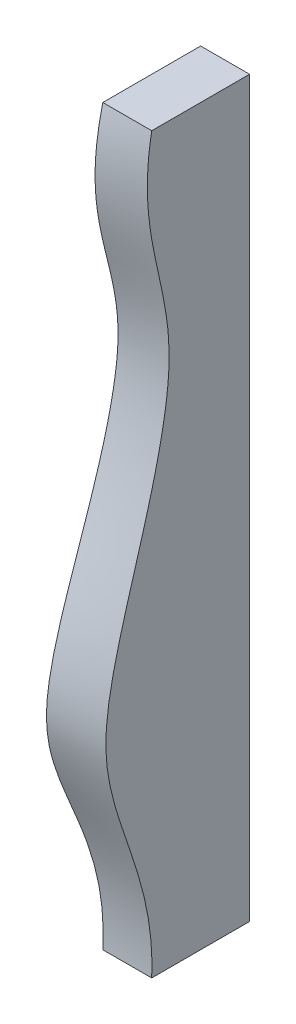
ISO-10303-21;
HEADER;
FILE_DESCRIPTION(('STEP AP214'),'2;1');
FILE_NAME('part.step','',(''),(''),'','','');
FILE_SCHEMA(('AUTOMOTIVE_DESIGN { 1 0 10303 214 1 1 1 1 }'));
ENDSEC;
DATA;
#1=APPLICATION_CONTEXT('core data for automotive mechanical design processes');
#2=APPLICATION_PROTOCOL_DEFINITION('international standard','automotive_design',2000,#1);
#3=PRODUCT_CONTEXT('',#1,'mechanical');
#4=PRODUCT('Part','Part','',(#3));
#5=PRODUCT_RELATED_PRODUCT_CATEGORY('part','',(#4));
#6=PRODUCT_DEFINITION_FORMATION('','',#4);
#7=PRODUCT_DEFINITION_CONTEXT('part definition',#1,'design');
#8=PRODUCT_DEFINITION('design','',#6,#7);
#9=PRODUCT_DEFINITION_SHAPE('','',#8);
#10=(LENGTH_UNIT() NAMED_UNIT(*) SI_UNIT(.MILLI.,.METRE.));
#11=(NAMED_UNIT(*) PLANE_ANGLE_UNIT() SI_UNIT($,.RADIAN.));
#12=(NAMED_UNIT(*) SI_UNIT($,.STERADIAN.) SOLID_ANGLE_UNIT());
#13=UNCERTAINTY_MEASURE_WITH_UNIT(LENGTH_MEASURE(1.E-05),#10,'distance_accuracy_value','');
#14=(GEOMETRIC_REPRESENTATION_CONTEXT(3) GLOBAL_UNCERTAINTY_ASSIGNED_CONTEXT((#13)) GLOBAL_UNIT_ASSIGNED_CONTEXT((#10,
#11,#12)) REPRESENTATION_CONTEXT('',''));
#15=CARTESIAN_POINT('',(0.,0.,0.));
#16=DIRECTION('',(0.,0.,1.));
#17=DIRECTION('',(1.,0.,0.));
#18=AXIS2_PLACEMENT_3D('',#15,#16,#17);
#19=CARTESIAN_POINT('',(550.,375.,253.120113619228));
#20=DIRECTION('',(1.,0.,0.));
#21=DIRECTION('',(0.,0.,-1.));
#22=AXIS2_PLACEMENT_3D('',#19,#20,#21);
#23=PLANE('',#22);
#24=CARTESIAN_POINT('',(550.,375.,100.));
#25=CARTESIAN_POINT('',(550.,373.766598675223,100.226293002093));
#26=CARTESIAN_POINT('',(550.,372.531755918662,100.444665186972));
#27=CARTESIAN_POINT('',(550.,370.059298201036,100.865180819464));
#28=CARTESIAN_POINT('',(550.,368.821683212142,101.067324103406));
#29=CARTESIAN_POINT('',(550.,365.106465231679,101.648575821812));
#30=CARTESIAN_POINT('',(550.,362.624913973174,102.002796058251));
#31=CARTESIAN_POINT('',(550.,357.654386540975,102.641695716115));
#32=CARTESIAN_POINT('',(550.,355.165415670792,102.92641643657));
#33=CARTESIAN_POINT('',(550.,350.181509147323,103.423922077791));
#34=CARTESIAN_POINT('',(550.,347.686577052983,103.636742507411));
#35=CARTESIAN_POINT('',(550.,342.692313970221,103.988558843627));
#36=CARTESIAN_POINT('',(550.,340.192984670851,104.127578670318));
#37=CARTESIAN_POINT('',(550.,335.191544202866,104.330561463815));
#38=CARTESIAN_POINT('',(550.,332.689433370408,104.394532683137));
#39=CARTESIAN_POINT('',(550.,327.751316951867,104.446294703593));
#40=CARTESIAN_POINT('',(550.,325.315331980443,104.436075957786));
#41=CARTESIAN_POINT('',(550.,320.444754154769,104.34467107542));
#42=CARTESIAN_POINT('',(550.,318.010161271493,104.263486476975));
#43=CARTESIAN_POINT('',(550.,313.144230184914,104.031732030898));
#44=CARTESIAN_POINT('',(550.,310.71289207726,103.881160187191));
#45=CARTESIAN_POINT('',(550.,305.855245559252,103.513359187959));
#46=CARTESIAN_POINT('',(550.,303.428937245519,103.296128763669));
#47=CARTESIAN_POINT('',(550.,298.583034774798,102.798961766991));
#48=CARTESIAN_POINT('',(550.,296.163439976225,102.519031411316));
#49=CARTESIAN_POINT('',(550.,291.33255220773,101.901679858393));
#50=CARTESIAN_POINT('',(550.,288.921256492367,101.564280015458));
#51=CARTESIAN_POINT('',(550.,284.115680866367,100.83954985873));
#52=CARTESIAN_POINT('',(550.,281.721371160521,100.452415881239));
#53=CARTESIAN_POINT('',(550.,276.940631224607,99.6344670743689));
#54=CARTESIAN_POINT('',(550.,274.554199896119,99.2036586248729));
#55=CARTESIAN_POINT('',(550.,269.787774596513,98.3063264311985));
#56=CARTESIAN_POINT('',(550.,267.407781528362,97.8397979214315));
#57=CARTESIAN_POINT('',(550.,262.652632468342,96.8797611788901));
#58=CARTESIAN_POINT('',(550.,260.277477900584,96.3862459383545));
#59=CARTESIAN_POINT('',(550.,255.530275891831,95.3816036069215));
#60=CARTESIAN_POINT('',(550.,253.158229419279,94.87047197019));
#61=CARTESIAN_POINT('',(550.,248.415418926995,93.8404258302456));
#62=CARTESIAN_POINT('',(550.,246.044655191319,93.3215100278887));
#63=CARTESIAN_POINT('',(550.,241.301893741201,92.2858490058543));
#64=CARTESIAN_POINT('',(550.,238.929895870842,91.7691044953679));
#65=CARTESIAN_POINT('',(550.,234.183556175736,90.7481086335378));
#66=CARTESIAN_POINT('',(550.,231.809214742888,90.2438554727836));
#67=CARTESIAN_POINT('',(550.,227.056474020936,89.2578518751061));
#68=CARTESIAN_POINT('',(550.,224.678075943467,88.7760956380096));
#69=CARTESIAN_POINT('',(550.,219.915585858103,87.8447094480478));
#70=CARTESIAN_POINT('',(550.,217.531495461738,87.39507131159));
#71=CARTESIAN_POINT('',(550.,212.756099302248,86.5369676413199));
#72=CARTESIAN_POINT('',(550.,210.364794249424,86.1284981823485));
#73=CARTESIAN_POINT('',(550.,205.573596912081,85.3610411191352));
#74=CARTESIAN_POINT('',(550.,203.173702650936,85.0020657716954));
#75=CARTESIAN_POINT('',(550.,198.324405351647,84.3355956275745));
#76=CARTESIAN_POINT('',(550.,195.874864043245,84.0290988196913));
#77=CARTESIAN_POINT('',(550.,190.967258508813,83.4820732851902));
#78=CARTESIAN_POINT('',(550.,188.50919091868,83.2415745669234));
#79=CARTESIAN_POINT('',(550.,183.586862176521,82.8323906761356));
#80=CARTESIAN_POINT('',(550.,181.122600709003,82.663709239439));
#81=CARTESIAN_POINT('',(550.,177.423450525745,82.4678007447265));
#82=CARTESIAN_POINT('',(550.,176.190021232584,82.4120186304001));
#83=CARTESIAN_POINT('',(550.,173.722424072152,82.3198774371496));
#84=CARTESIAN_POINT('',(550.,172.488256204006,82.2835183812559));
#85=CARTESIAN_POINT('',(550.,170.019792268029,82.2305644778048));
#86=CARTESIAN_POINT('',(550.,168.785496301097,82.2139649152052));
#87=CARTESIAN_POINT('',(550.,166.316799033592,82.2007662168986));
#88=CARTESIAN_POINT('',(550.,165.082397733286,82.2041670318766));
#89=CARTESIAN_POINT('',(550.,162.614127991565,82.2311139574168));
#90=CARTESIAN_POINT('',(550.,161.380259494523,82.2546549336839));
#91=CARTESIAN_POINT('',(550.,158.913079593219,82.3220442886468));
#92=CARTESIAN_POINT('',(550.,157.67976818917,82.3658926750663));
#93=CARTESIAN_POINT('',(550.,155.213489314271,82.4726365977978));
#94=CARTESIAN_POINT('',(550.,153.980522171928,82.5355396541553));
#95=CARTESIAN_POINT('',(550.,151.51562332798,82.679081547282));
#96=CARTESIAN_POINT('',(550.,150.283691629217,82.7597204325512));
#97=CARTESIAN_POINT('',(550.,147.820795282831,82.9375927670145));
#98=CARTESIAN_POINT('',(550.,146.589830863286,83.0348293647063));
#99=CARTESIAN_POINT('',(550.,144.12923723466,83.2448199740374));
#100=CARTESIAN_POINT('',(550.,142.8996080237,83.3575739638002));
#101=CARTESIAN_POINT('',(550.,139.211895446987,83.717720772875));
#102=CARTESIAN_POINT('',(550.,136.755920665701,83.9869294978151));
#103=CARTESIAN_POINT('',(550.,131.849282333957,84.5766510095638));
#104=CARTESIAN_POINT('',(550.,129.398621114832,84.897182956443));
#105=CARTESIAN_POINT('',(550.,124.503224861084,85.5837793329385));
#106=CARTESIAN_POINT('',(550.,122.058491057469,85.9498525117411));
#107=CARTESIAN_POINT('',(550.,117.175789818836,86.7230178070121));
#108=CARTESIAN_POINT('',(550.,114.737821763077,87.13010602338));
#109=CARTESIAN_POINT('',(550.,108.590047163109,88.2047589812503));
#110=CARTESIAN_POINT('',(550.,104.884523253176,88.8968659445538));
#111=CARTESIAN_POINT('',(550.,97.4897891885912,90.3545183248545));
#112=CARTESIAN_POINT('',(550.,93.8005724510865,91.1200305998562));
#113=CARTESIAN_POINT('',(550.,86.4363813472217,92.7141691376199));
#114=CARTESIAN_POINT('',(550.,82.761405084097,93.5427866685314));
#115=CARTESIAN_POINT('',(550.,75.4239869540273,95.2540986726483));
#116=CARTESIAN_POINT('',(550.,71.7615454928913,96.1367948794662));
#117=CARTESIAN_POINT('',(550.,64.447702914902,97.9481942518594));
#118=CARTESIAN_POINT('',(550.,60.796302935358,98.8769019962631));
#119=CARTESIAN_POINT('',(550.,53.5032161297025,100.77294120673));
#120=CARTESIAN_POINT('',(550.,49.8615302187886,101.740276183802));
#121=CARTESIAN_POINT('',(550.,42.5455349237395,103.717772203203));
#122=CARTESIAN_POINT('',(550.,38.8713233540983,104.728294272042));
#123=CARTESIAN_POINT('',(550.,31.5301570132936,106.774988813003));
#124=CARTESIAN_POINT('',(550.,27.8632020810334,107.811160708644));
#125=CARTESIAN_POINT('',(550.,20.5351230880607,109.902516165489));
#126=CARTESIAN_POINT('',(550.,16.8739984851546,110.95769783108));
#127=CARTESIAN_POINT('',(550.,9.55614718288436,113.080405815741));
#128=CARTESIAN_POINT('',(550.,5.8994197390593,114.147929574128));
#129=CARTESIAN_POINT('',(550.,-1.41112448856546,116.288466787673));
#130=CARTESIAN_POINT('',(550.,-5.06494183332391,117.361478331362));
#131=CARTESIAN_POINT('',(550.,-12.3712560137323,119.505779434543));
#132=CARTESIAN_POINT('',(550.,-16.0237526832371,120.577069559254));
#133=CARTESIAN_POINT('',(550.,-23.3817516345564,122.725532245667));
#134=CARTESIAN_POINT('',(550.,-27.0872898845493,123.802582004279));
#135=CARTESIAN_POINT('',(550.,-34.5029335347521,125.938650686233));
#136=CARTESIAN_POINT('',(550.,-38.2130381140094,126.997672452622));
#137=CARTESIAN_POINT('',(550.,-45.6423294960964,129.088308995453));
#138=CARTESIAN_POINT('',(550.,-49.3615189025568,130.119914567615));
#139=CARTESIAN_POINT('',(550.,-54.9499670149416,131.638301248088));
#140=CARTESIAN_POINT('',(550.,-56.815224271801,132.139809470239));
#141=CARTESIAN_POINT('',(550.,-60.5487858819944,133.131342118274));
#142=CARTESIAN_POINT('',(550.,-62.4170902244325,133.621366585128));
#143=CARTESIAN_POINT('',(550.,-66.1600131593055,134.58892580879));
#144=CARTESIAN_POINT('',(550.,-68.0346370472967,135.066440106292));
#145=CARTESIAN_POINT('',(550.,-71.7876997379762,136.006259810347));
#146=CARTESIAN_POINT('',(550.,-73.6661385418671,136.468565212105));
#147=CARTESIAN_POINT('',(550.,-77.4316720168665,137.376932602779));
#148=CARTESIAN_POINT('',(550.,-79.3187766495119,137.822953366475));
#149=CARTESIAN_POINT('',(550.,-83.0975512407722,138.695254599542));
#150=CARTESIAN_POINT('',(550.,-84.9892211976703,139.121535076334));
#151=CARTESIAN_POINT('',(550.,-88.7245073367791,139.940179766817));
#152=CARTESIAN_POINT('',(550.,-90.5679884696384,140.333158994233));
#153=CARTESIAN_POINT('',(550.,-94.2598510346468,141.095440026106));
#154=CARTESIAN_POINT('',(550.,-96.1082324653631,141.464741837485));
#155=CARTESIAN_POINT('',(550.,-99.8110479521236,142.176994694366));
#156=CARTESIAN_POINT('',(550.,-101.665484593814,142.519932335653));
#157=CARTESIAN_POINT('',(550.,-105.379624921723,143.176110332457));
#158=CARTESIAN_POINT('',(550.,-107.23932861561,143.489350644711));
#159=CARTESIAN_POINT('',(550.,-110.961128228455,144.082223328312));
#160=CARTESIAN_POINT('',(550.,-112.823215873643,144.361907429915));
#161=CARTESIAN_POINT('',(550.,-116.552565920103,144.884478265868));
#162=CARTESIAN_POINT('',(550.,-118.419828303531,145.127365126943));
#163=CARTESIAN_POINT('',(550.,-122.153865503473,145.571607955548));
#164=CARTESIAN_POINT('',(550.,-124.020626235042,145.773081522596));
#165=CARTESIAN_POINT('',(550.,-127.758509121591,146.130977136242));
#166=CARTESIAN_POINT('',(550.,-129.629631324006,146.287398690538));
#167=CARTESIAN_POINT('',(550.,-133.369729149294,146.550062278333));
#168=CARTESIAN_POINT('',(550.,-135.238693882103,146.656456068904));
#169=CARTESIAN_POINT('',(550.,-138.043810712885,146.775205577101));
#170=CARTESIAN_POINT('',(550.,-138.979127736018,146.807981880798));
#171=CARTESIAN_POINT('',(550.,-140.850161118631,146.85927264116));
#172=CARTESIAN_POINT('',(550.,-141.785877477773,146.877787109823));
#173=CARTESIAN_POINT('',(550.,-143.655861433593,146.899893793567));
#174=CARTESIAN_POINT('',(550.,-144.590128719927,146.903511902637));
#175=CARTESIAN_POINT('',(550.,-146.458593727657,146.89518659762));
#176=CARTESIAN_POINT('',(550.,-147.39279144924,146.883243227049));
#177=CARTESIAN_POINT('',(550.,-149.260883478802,146.843806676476));
#178=CARTESIAN_POINT('',(550.,-150.194777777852,146.816313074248));
#179=CARTESIAN_POINT('',(550.,-152.061991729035,146.745949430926));
#180=CARTESIAN_POINT('',(550.,-152.995311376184,146.703079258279));
#181=CARTESIAN_POINT('',(550.,-155.097300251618,146.589395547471));
#182=CARTESIAN_POINT('',(550.,-156.265737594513,146.51425550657));
#183=CARTESIAN_POINT('',(550.,-158.600887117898,146.340741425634));
#184=CARTESIAN_POINT('',(550.,-159.767599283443,146.242367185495));
#185=CARTESIAN_POINT('',(550.,-162.098932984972,146.023021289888));
#186=CARTESIAN_POINT('',(550.,-163.263554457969,145.902048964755));
#187=CARTESIAN_POINT('',(550.,-165.59031461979,145.638145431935));
#188=CARTESIAN_POINT('',(550.,-166.752453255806,145.495213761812));
#189=CARTESIAN_POINT('',(550.,-170.242024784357,145.033591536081));
#190=CARTESIAN_POINT('',(550.,-172.565272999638,144.682772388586));
#191=CARTESIAN_POINT('',(550.,-177.198357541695,143.90254763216));
#192=CARTESIAN_POINT('',(550.,-179.508194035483,143.473143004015));
#193=CARTESIAN_POINT('',(550.,-184.120324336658,142.54223613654));
#194=CARTESIAN_POINT('',(550.,-186.422575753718,142.04052482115));
#195=CARTESIAN_POINT('',(550.,-191.012606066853,140.974465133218));
#196=CARTESIAN_POINT('',(550.,-193.300383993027,140.410112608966));
#197=CARTESIAN_POINT('',(550.,-197.862864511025,139.227395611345));
#198=CARTESIAN_POINT('',(550.,-200.137561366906,138.609009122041));
#199=CARTESIAN_POINT('',(550.,-204.674150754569,137.327324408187));
#200=CARTESIAN_POINT('',(550.,-206.936043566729,136.664027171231));
#201=CARTESIAN_POINT('',(550.,-211.506829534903,135.283733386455));
#202=CARTESIAN_POINT('',(550.,-213.815437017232,134.565794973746));
#203=CARTESIAN_POINT('',(550.,-218.423407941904,133.100954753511));
#204=CARTESIAN_POINT('',(550.,-220.722771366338,132.354052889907));
#205=CARTESIAN_POINT('',(550.,-225.3099588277,130.841590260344));
#206=CARTESIAN_POINT('',(550.,-227.597796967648,130.076072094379));
#207=CARTESIAN_POINT('',(550.,-232.169420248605,128.533085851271));
#208=CARTESIAN_POINT('',(550.,-234.453205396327,127.75561779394));
#209=CARTESIAN_POINT('',(550.,-239.017689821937,126.197065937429));
#210=CARTESIAN_POINT('',(550.,-241.298390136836,125.415985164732));
#211=CARTESIAN_POINT('',(550.,-245.860872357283,123.856968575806));
#212=CARTESIAN_POINT('',(550.,-248.142654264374,123.079032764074));
#213=CARTESIAN_POINT('',(550.,-252.71077454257,121.532829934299));
#214=CARTESIAN_POINT('',(550.,-254.997114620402,120.764567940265));
#215=CARTESIAN_POINT('',(550.,-259.575297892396,119.244639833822));
#216=CARTESIAN_POINT('',(550.,-261.86714104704,118.49297360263));
#217=CARTESIAN_POINT('',(550.,-267.161938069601,116.78545362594));
#218=CARTESIAN_POINT('',(550.,-270.167501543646,115.837646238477));
#219=CARTESIAN_POINT('',(550.,-276.196343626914,113.993174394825));
#220=CARTESIAN_POINT('',(550.,-279.219631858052,113.09654124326));
#221=CARTESIAN_POINT('',(550.,-285.284365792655,111.366884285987));
#222=CARTESIAN_POINT('',(550.,-288.325811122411,110.53385917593));
#223=CARTESIAN_POINT('',(550.,-294.426942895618,108.942531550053));
#224=CARTESIAN_POINT('',(550.,-297.486621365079,108.184198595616));
#225=CARTESIAN_POINT('',(550.,-303.623940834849,106.751988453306));
#226=CARTESIAN_POINT('',(550.,-306.701570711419,106.078063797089));
#227=CARTESIAN_POINT('',(550.,-312.87416084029,104.823036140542));
#228=CARTESIAN_POINT('',(550.,-315.969111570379,104.241886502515));
#229=CARTESIAN_POINT('',(550.,-322.138501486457,103.185742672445));
#230=CARTESIAN_POINT('',(550.,-325.212734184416,102.709546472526));
#231=CARTESIAN_POINT('',(550.,-331.375758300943,101.860195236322));
#232=CARTESIAN_POINT('',(550.,-334.464551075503,101.487049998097));
#233=CARTESIAN_POINT('',(550.,-340.655825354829,100.848059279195));
#234=CARTESIAN_POINT('',(550.,-343.758316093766,100.582303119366));
#235=CARTESIAN_POINT('',(550.,-349.976181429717,100.161315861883));
#236=CARTESIAN_POINT('',(550.,-353.091568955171,100.006273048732));
#237=CARTESIAN_POINT('',(550.,-357.771309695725,99.8583590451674));
#238=CARTESIAN_POINT('',(550.,-359.334431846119,99.8231726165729));
#239=CARTESIAN_POINT('',(550.,-362.461078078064,99.7812956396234));
#240=CARTESIAN_POINT('',(550.,-364.024602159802,99.7746051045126));
#241=CARTESIAN_POINT('',(550.,-367.157202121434,99.7897852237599));
#242=CARTESIAN_POINT('',(550.,-368.726277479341,99.8117600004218));
#243=CARTESIAN_POINT('',(550.,-371.863765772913,99.8843874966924));
#244=CARTESIAN_POINT('',(550.,-373.432178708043,99.9350402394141));
#245=CARTESIAN_POINT('',(550.,-375.,100.));
#246=B_SPLINE_CURVE_WITH_KNOTS('',3,(#24,#25,#26,#27,#28,#29,#30,#31,#32,#33,#34,#35,#36,#37,
#38,#39,#40,#41,#42,#43,#44,#45,#46,#47,#48,#49,#50,#51,#52,#53,#54,#55,#56,#57,#58,#59,#60,#61,
#62,#63,#64,#65,#66,#67,#68,#69,#70,#71,#72,#73,#74,#75,#76,#77,#78,#79,#80,#81,#82,#83,#84,#85,
#86,#87,#88,#89,#90,#91,#92,#93,#94,#95,#96,#97,#98,#99,#100,#101,#102,#103,#104,#105,#106,#107,
#108,#109,#110,#111,#112,#113,#114,#115,#116,#117,#118,#119,#120,#121,#122,#123,#124,#125,#126,
#127,#128,#129,#130,#131,#132,#133,#134,#135,#136,#137,#138,#139,#140,#141,#142,#143,#144,#145,
#146,#147,#148,#149,#150,#151,#152,#153,#154,#155,#156,#157,#158,#159,#160,#161,#162,#163,#164,
#165,#166,#167,#168,#169,#170,#171,#172,#173,#174,#175,#176,#177,#178,#179,#180,#181,#182,#183,
#184,#185,#186,#187,#188,#189,#190,#191,#192,#193,#194,#195,#196,#197,#198,#199,#200,#201,#202,
#203,#204,#205,#206,#207,#208,#209,#210,#211,#212,#213,#214,#215,#216,#217,#218,#219,#220,#221,
#222,#223,#224,#225,#226,#227,#228,#229,#230,#231,#232,#233,#234,#235,#236,#237,#238,#239,#240,
#241,#242,#243,#244,#245),.UNSPECIFIED.,.F.,.F.,(4,2,2,2,2,2,2,2,2,2,2,2,2,2,2,2,2,2,2,2,2,2,2,
2,2,2,2,2,2,2,2,2,2,2,2,2,2,2,2,2,2,2,2,2,2,2,2,2,2,2,2,2,2,2,2,2,2,2,2,2,2,2,2,2,2,2,2,2,2,2,2,
2,2,2,2,2,2,2,2,2,2,2,2,2,2,2,2,2,2,2,2,2,2,2,2,2,2,2,2,2,2,2,2,2,2,2,2,2,2,2,4),(0.,
3.76191391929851,7.52386577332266,15.0429658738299,22.5575869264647,30.0684913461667,
37.5769598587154,45.0846026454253,52.3915808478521,59.6984006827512,67.005430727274,
74.3125998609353,81.6190448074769,88.9227807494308,96.198522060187,103.473202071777,
110.748854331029,118.026404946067,125.305847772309,132.586519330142,139.869408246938,
147.151235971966,154.431175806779,161.709254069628,168.986637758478,176.265820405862,
183.670925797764,191.079392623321,198.488244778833,202.192188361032,205.896136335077,
209.599200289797,213.302255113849,217.004366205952,220.706478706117,224.410054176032,
228.1136397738,231.817928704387,235.522212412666,242.93358729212,250.347735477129,
257.763310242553,265.178180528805,276.486047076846,287.788832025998,299.090055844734,
310.391642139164,321.694355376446,332.998098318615,344.429903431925,355.86145184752,
367.291866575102,378.719950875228,390.144294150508,401.563379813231,413.140031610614,
424.714840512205,436.29348748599,442.087960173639,447.882412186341,453.685813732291,
459.489217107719,465.306415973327,471.123612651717,476.778180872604,482.432747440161,
488.090170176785,493.747601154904,499.396195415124,505.044770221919,510.677076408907,
516.30944414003,521.92461431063,524.732198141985,527.53977961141,530.342478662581,
533.145169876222,535.947937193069,538.750728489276,542.263033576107,545.775368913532,
549.28780835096,552.800321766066,559.84745522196,566.894500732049,573.962347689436,
581.030663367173,588.10187255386,595.172926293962,602.425667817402,609.678423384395,
616.91590742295,624.153379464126,631.385609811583,638.617850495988,645.853703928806,
653.089505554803,662.543548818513,672.003314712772,681.462886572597,690.91858736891,
700.368946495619,709.814539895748,719.145573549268,728.477494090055,737.817160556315,
747.172672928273,751.863013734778,756.553356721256,761.260784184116,765.968215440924),.UNSPECIFIED.);
#247=CARTESIAN_POINT('',(550.,375.,100.));
#248=VERTEX_POINT('',#247);
#249=CARTESIAN_POINT('',(550.,-375.,100.));
#250=VERTEX_POINT('',#249);
#251=EDGE_CURVE('E88',#248,#250,#246,.T.);
#252=ORIENTED_EDGE('',*,*,#251,.T.);
#253=DIRECTION('',(0.,0.,-1.));
#254=VECTOR('',#253,1.);
#255=CARTESIAN_POINT('',(550.,-375.,253.120113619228));
#256=LINE('',#255,#254);
#257=CARTESIAN_POINT('',(550.,-375.,0.));
#258=VERTEX_POINT('',#257);
#259=EDGE_CURVE('E50',#250,#258,#256,.T.);
#260=ORIENTED_EDGE('',*,*,#259,.T.);
#261=DIRECTION('',(0.,-1.,0.));
#262=VECTOR('',#261,1.);
#263=CARTESIAN_POINT('',(550.,375.,0.));
#264=LINE('',#263,#262);
#265=CARTESIAN_POINT('',(550.,375.,0.));
#266=VERTEX_POINT('',#265);
#267=EDGE_CURVE('E87',#266,#258,#264,.T.);
#268=ORIENTED_EDGE('',*,*,#267,.F.);
#269=DIRECTION('',(0.,0.,-1.));
#270=VECTOR('',#269,1.);
#271=CARTESIAN_POINT('',(550.,375.,253.120113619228));
#272=LINE('',#271,#270);
#273=EDGE_CURVE('E65',#248,#266,#272,.T.);
#274=ORIENTED_EDGE('',*,*,#273,.F.);
#275=EDGE_LOOP('',(#252,#260,#268,#274));
#276=FACE_BOUND('',#275,.T.);
#277=ADVANCED_FACE('F35',(#276),#23,.T.);
#278=CARTESIAN_POINT('',(0.,0.,0.));
#279=DIRECTION('',(0.,0.,-1.));
#280=DIRECTION('',(-1.,0.,0.));
#281=AXIS2_PLACEMENT_3D('',#278,#279,#280);
#282=PLANE('',#281);
#283=DIRECTION('',(1.,0.,0.));
#284=VECTOR('',#283,1.);
#285=CARTESIAN_POINT('',(-750.,-375.,0.));
#286=LINE('',#285,#284);
#287=CARTESIAN_POINT('',(500.,-375.,0.));
#288=VERTEX_POINT('',#287);
#289=EDGE_CURVE('E79',#288,#258,#286,.T.);
#290=ORIENTED_EDGE('',*,*,#289,.F.);
#291=DIRECTION('',(0.,1.,0.));
#292=VECTOR('',#291,1.);
#293=CARTESIAN_POINT('',(500.,375.,0.));
#294=LINE('',#293,#292);
#295=CARTESIAN_POINT('',(500.,375.,0.));
#296=VERTEX_POINT('',#295);
#297=EDGE_CURVE('E157',#288,#296,#294,.T.);
#298=ORIENTED_EDGE('',*,*,#297,.T.);
#299=DIRECTION('',(-1.,0.,0.));
#300=VECTOR('',#299,1.);
#301=CARTESIAN_POINT('',(-750.,375.,0.));
#302=LINE('',#301,#300);
#303=EDGE_CURVE('E93',#266,#296,#302,.T.);
#304=ORIENTED_EDGE('',*,*,#303,.F.);
#305=ORIENTED_EDGE('',*,*,#267,.T.);
#306=EDGE_LOOP('',(#290,#298,#304,#305));
#307=FACE_BOUND('',#306,.T.);
#308=ADVANCED_FACE('F91',(#307),#282,.T.);
#309=CARTESIAN_POINT('',(750.,-375.,100.));
#310=CARTESIAN_POINT('',(750.,-302.078506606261,100.));
#311=CARTESIAN_POINT('',(750.,-224.483786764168,100.));
#312=CARTESIAN_POINT('',(750.,-61.5160152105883,100.));
#313=CARTESIAN_POINT('',(750.,39.4445673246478,100.));
#314=CARTESIAN_POINT('',(750.,211.849847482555,100.));
#315=CARTESIAN_POINT('',(750.,298.882075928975,100.));
#316=CARTESIAN_POINT('',(750.,375.,100.));
#317=CARTESIAN_POINT('',(669.085175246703,-375.,100.));
#318=CARTESIAN_POINT('',(669.085175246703,-302.078506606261,100.));
#319=CARTESIAN_POINT('',(669.085175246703,-234.282472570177,121.198481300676));
#320=CARTESIAN_POINT('',(669.085175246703,-62.2283080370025,120.288550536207));
#321=CARTESIAN_POINT('',(669.085175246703,68.0647781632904,82.7868169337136));
#322=CARTESIAN_POINT('',(669.085175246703,240.312514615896,73.0426687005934));
#323=CARTESIAN_POINT('',(669.085175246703,298.882075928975,100.));
#324=CARTESIAN_POINT('',(669.085175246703,375.,100.));
#325=CARTESIAN_POINT('',(500.445116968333,-375.,100.));
#326=CARTESIAN_POINT('',(517.991528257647,-284.627602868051,95.5040591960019));
#327=CARTESIAN_POINT('',(530.038001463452,-221.673003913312,150.719602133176));
#328=CARTESIAN_POINT('',(473.74510655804,-71.7416270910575,167.060530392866));
#329=CARTESIAN_POINT('',(387.213321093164,45.6135081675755,91.591323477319));
#330=CARTESIAN_POINT('',(378.694107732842,207.638743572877,66.6461848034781));
#331=CARTESIAN_POINT('',(433.17831170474,253.396603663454,122.492891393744));
#332=CARTESIAN_POINT('',(500.445116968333,375.,100.));
#333=CARTESIAN_POINT('',(285.091607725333,-375.,100.));
#334=CARTESIAN_POINT('',(309.270321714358,-264.297524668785,86.4064578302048));
#335=CARTESIAN_POINT('',(325.856840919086,-200.08226970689,164.07204721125));
#336=CARTESIAN_POINT('',(247.47112957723,-80.9425320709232,234.992870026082));
#337=CARTESIAN_POINT('',(127.240382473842,2.40271344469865,186.756001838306));
#338=CARTESIAN_POINT('',(115.567806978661,152.518027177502,151.057444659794));
#339=CARTESIAN_POINT('',(191.428893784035,202.025100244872,189.039851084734));
#340=CARTESIAN_POINT('',(285.091607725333,375.,100.));
#341=CARTESIAN_POINT('',(47.4554331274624,-375.,100.));
#342=CARTESIAN_POINT('',(51.0669239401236,-278.639867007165,99.5141662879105));
#343=CARTESIAN_POINT('',(52.9210710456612,-231.452124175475,201.325948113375));
#344=CARTESIAN_POINT('',(3.18149891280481,-90.8615864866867,272.445475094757));
#345=CARTESIAN_POINT('',(-61.0346058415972,45.7948958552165,186.157760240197));
#346=CARTESIAN_POINT('',(-59.6612105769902,205.286893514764,133.941969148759));
#347=CARTESIAN_POINT('',(-11.8049718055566,220.40073671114,189.8209162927));
#348=CARTESIAN_POINT('',(47.4554331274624,375.,100.));
#349=CARTESIAN_POINT('',(-175.903454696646,-375.,100.));
#350=CARTESIAN_POINT('',(-199.823715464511,-320.588060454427,126.731848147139));
#351=CARTESIAN_POINT('',(-216.967937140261,-300.821135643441,242.921959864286));
#352=CARTESIAN_POINT('',(-184.265304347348,-55.1410097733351,206.147478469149));
#353=CARTESIAN_POINT('',(-119.865061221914,249.096629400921,-32.5779079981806));
#354=CARTESIAN_POINT('',(-104.641938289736,431.262460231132,-94.4845569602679));
#355=CARTESIAN_POINT('',(-136.623034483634,348.137040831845,60.785640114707));
#356=CARTESIAN_POINT('',(-175.903454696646,375.,100.));
#357=CARTESIAN_POINT('',(-355.235514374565,-375.,100.));
#358=CARTESIAN_POINT('',(-319.200833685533,-282.590755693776,58.2859511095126));
#359=CARTESIAN_POINT('',(-293.075279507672,-226.888141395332,104.97090627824));
#360=CARTESIAN_POINT('',(-324.119079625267,-68.6572837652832,122.102733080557));
#361=CARTESIAN_POINT('',(-398.972481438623,73.039345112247,53.3701087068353));
#362=CARTESIAN_POINT('',(-423.398679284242,233.384819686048,47.4380317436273));
#363=CARTESIAN_POINT('',(-392.720188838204,253.575952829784,124.952096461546));
#364=CARTESIAN_POINT('',(-355.235514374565,375.,100.));
#365=CARTESIAN_POINT('',(-536.684515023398,-375.,100.));
#366=CARTESIAN_POINT('',(-494.827225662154,-277.129657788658,52.0422385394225));
#367=CARTESIAN_POINT('',(-464.573647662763,-205.017596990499,67.039018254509));
#368=CARTESIAN_POINT('',(-506.334367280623,-72.2467511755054,96.5036749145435));
#369=CARTESIAN_POINT('',(-600.216684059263,9.35641022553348,95.9941925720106));
#370=CARTESIAN_POINT('',(-628.122542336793,166.946160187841,106.349064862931));
#371=CARTESIAN_POINT('',(-587.011939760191,237.095914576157,138.331902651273));
#372=CARTESIAN_POINT('',(-536.684515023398,375.,100.));
#373=CARTESIAN_POINT('',(-644.685568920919,-375.,100.));
#374=CARTESIAN_POINT('',(-644.685568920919,-302.078506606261,100.));
#375=CARTESIAN_POINT('',(-644.685568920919,-237.237234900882,127.59081546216));
#376=CARTESIAN_POINT('',(-644.685568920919,-62.4430976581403,126.406497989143));
#377=CARTESIAN_POINT('',(-644.685568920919,76.6951111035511,77.5962366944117));
#378=CARTESIAN_POINT('',(-644.685568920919,248.895340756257,64.9137717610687));
#379=CARTESIAN_POINT('',(-644.685568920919,298.882075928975,100.));
#380=CARTESIAN_POINT('',(-644.685568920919,375.,100.));
#381=CARTESIAN_POINT('',(-750.,-375.,100.));
#382=CARTESIAN_POINT('',(-750.,-302.078506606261,100.));
#383=CARTESIAN_POINT('',(-750.,-224.483786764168,100.));
#384=CARTESIAN_POINT('',(-750.,-61.5160152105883,100.));
#385=CARTESIAN_POINT('',(-750.,39.4445673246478,100.));
#386=CARTESIAN_POINT('',(-750.,211.849847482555,100.));
#387=CARTESIAN_POINT('',(-750.,298.882075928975,100.));
#388=CARTESIAN_POINT('',(-750.,375.,100.));
#389=B_SPLINE_SURFACE_WITH_KNOTS('',3,3,((#309,#310,#311,#312,#313,#314,#315,#316),(#317,#318,
#319,#320,#321,#322,#323,#324),(#325,#326,#327,#328,#329,#330,#331,#332),(#333,#334,#335,#336,
#337,#338,#339,#340),(#341,#342,#343,#344,#345,#346,#347,#348),(#349,#350,#351,#352,#353,#354,
#355,#356),(#357,#358,#359,#360,#361,#362,#363,#364),(#365,#366,#367,#368,#369,#370,#371,#372),
(#373,#374,#375,#376,#377,#378,#379,#380),(#381,#382,#383,#384,#385,#386,#387,#388)),
.UNSPECIFIED.,.F.,.F.,.F.,(4,1,1,1,1,1,1,4),(4,1,1,1,1,4),(0.,0.161829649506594,
0.33728011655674,0.430707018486,0.637101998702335,0.783997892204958,0.789371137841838,1.),(0.,
0.291685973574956,0.310378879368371,0.65187108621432,0.695528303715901,1.),.UNSPECIFIED.);
#390=CARTESIAN_POINT('',(500.,-375.,100.));
#391=CARTESIAN_POINT('',(500.,-373.86579472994,99.9348858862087));
#392=CARTESIAN_POINT('',(500.,-372.731146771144,99.8777348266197));
#393=CARTESIAN_POINT('',(500.,-370.461153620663,99.7794710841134));
#394=CARTESIAN_POINT('',(500.,-369.325808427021,99.7383584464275));
#395=CARTESIAN_POINT('',(500.,-365.920852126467,99.6393003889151));
#396=CARTESIAN_POINT('',(500.,-363.650488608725,99.6055293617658));
#397=CARTESIAN_POINT('',(500.,-359.111140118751,99.6031119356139));
#398=CARTESIAN_POINT('',(500.,-356.842155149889,99.6344258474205));
#399=CARTESIAN_POINT('',(500.,-352.306971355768,99.7623367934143));
#400=CARTESIAN_POINT('',(500.,-350.040771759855,99.8589063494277));
#401=CARTESIAN_POINT('',(500.,-345.51261150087,100.11716902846));
#402=CARTESIAN_POINT('',(500.,-343.250649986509,100.278847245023));
#403=CARTESIAN_POINT('',(500.,-338.732390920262,100.666822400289));
#404=CARTESIAN_POINT('',(500.,-336.476093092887,100.893116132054));
#405=CARTESIAN_POINT('',(500.,-332.044540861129,101.400970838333));
#406=CARTESIAN_POINT('',(500.,-329.869050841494,101.680480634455));
#407=CARTESIAN_POINT('',(500.,-325.526227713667,102.2979496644));
#408=CARTESIAN_POINT('',(500.,-323.358895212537,102.635913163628));
#409=CARTESIAN_POINT('',(500.,-319.033669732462,103.368762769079));
#410=CARTESIAN_POINT('',(500.,-316.875777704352,103.763654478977));
#411=CARTESIAN_POINT('',(500.,-312.57063932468,104.608462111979));
#412=CARTESIAN_POINT('',(500.,-310.423393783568,105.05838215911));
#413=CARTESIAN_POINT('',(500.,-306.140681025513,106.010967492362));
#414=CARTESIAN_POINT('',(500.,-304.005213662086,106.513632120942));
#415=CARTESIAN_POINT('',(500.,-299.747113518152,107.569039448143));
#416=CARTESIAN_POINT('',(500.,-297.624478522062,108.121773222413));
#417=CARTESIAN_POINT('',(500.,-293.399919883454,109.272378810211));
#418=CARTESIAN_POINT('',(500.,-291.297948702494,109.870076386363));
#419=CARTESIAN_POINT('',(500.,-287.107201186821,111.109177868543));
#420=CARTESIAN_POINT('',(500.,-285.018423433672,111.75057698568));
#421=CARTESIAN_POINT('',(500.,-280.853663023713,113.073740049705));
#422=CARTESIAN_POINT('',(500.,-278.777680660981,113.755504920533));
#423=CARTESIAN_POINT('',(500.,-274.638009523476,115.155758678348));
#424=CARTESIAN_POINT('',(500.,-272.574321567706,115.874249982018));
#425=CARTESIAN_POINT('',(500.,-268.458632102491,117.344003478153));
#426=CARTESIAN_POINT('',(500.,-266.406630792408,118.095266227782));
#427=CARTESIAN_POINT('',(500.,-262.313597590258,119.62628388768));
#428=CARTESIAN_POINT('',(500.,-260.272564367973,120.406035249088));
#429=CARTESIAN_POINT('',(500.,-256.16835243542,122.001968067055));
#430=CARTESIAN_POINT('',(500.,-254.105320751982,122.818526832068));
#431=CARTESIAN_POINT('',(500.,-249.987613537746,124.471522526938));
#432=CARTESIAN_POINT('',(500.,-247.932936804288,125.307956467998));
#433=CARTESIAN_POINT('',(500.,-243.829734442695,126.995582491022));
#434=CARTESIAN_POINT('',(500.,-241.781208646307,127.846774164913));
#435=CARTESIAN_POINT('',(500.,-237.687946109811,129.558418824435));
#436=CARTESIAN_POINT('',(500.,-235.643209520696,130.418872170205));
#437=CARTESIAN_POINT('',(500.,-231.55499033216,132.143130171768));
#438=CARTESIAN_POINT('',(500.,-229.511507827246,133.006935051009));
#439=CARTESIAN_POINT('',(500.,-225.423073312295,134.731536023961));
#440=CARTESIAN_POINT('',(500.,-223.378121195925,135.592331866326));
#441=CARTESIAN_POINT('',(500.,-219.261281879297,137.313492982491));
#442=CARTESIAN_POINT('',(500.,-217.189348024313,138.173747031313));
#443=CARTESIAN_POINT('',(500.,-213.038221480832,139.876372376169));
#444=CARTESIAN_POINT('',(500.,-210.959029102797,140.718744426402));
#445=CARTESIAN_POINT('',(500.,-206.790323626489,142.377274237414));
#446=CARTESIAN_POINT('',(500.,-204.70081117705,143.193433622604));
#447=CARTESIAN_POINT('',(500.,-200.50819100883,144.790649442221));
#448=CARTESIAN_POINT('',(500.,-198.405082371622,145.571703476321));
#449=CARTESIAN_POINT('',(500.,-194.181790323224,147.089277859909));
#450=CARTESIAN_POINT('',(500.,-192.06160014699,147.825779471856));
#451=CARTESIAN_POINT('',(500.,-187.800469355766,149.244315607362));
#452=CARTESIAN_POINT('',(500.,-185.659509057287,149.926291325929));
#453=CARTESIAN_POINT('',(500.,-181.401617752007,151.210739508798));
#454=CARTESIAN_POINT('',(500.,-179.285094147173,151.814555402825));
#455=CARTESIAN_POINT('',(500.,-175.031010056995,152.948591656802));
#456=CARTESIAN_POINT('',(500.,-172.893438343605,153.478770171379));
#457=CARTESIAN_POINT('',(500.,-168.600225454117,154.454607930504));
#458=CARTESIAN_POINT('',(500.,-166.444594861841,154.900313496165));
#459=CARTESIAN_POINT('',(500.,-162.118330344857,155.697559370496));
#460=CARTESIAN_POINT('',(500.,-159.947716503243,156.049207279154));
#461=CARTESIAN_POINT('',(500.,-156.68272614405,156.500178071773));
#462=CARTESIAN_POINT('',(500.,-155.593527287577,156.63769309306));
#463=CARTESIAN_POINT('',(500.,-153.412128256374,156.886244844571));
#464=CARTESIAN_POINT('',(500.,-152.319928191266,156.997282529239));
#465=CARTESIAN_POINT('',(500.,-150.134071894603,157.191879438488));
#466=CARTESIAN_POINT('',(500.,-149.040417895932,157.275463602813));
#467=CARTESIAN_POINT('',(500.,-147.398624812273,157.379842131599));
#468=CARTESIAN_POINT('',(500.,-146.851137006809,157.41113553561));
#469=CARTESIAN_POINT('',(500.,-145.755800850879,157.466652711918));
#470=CARTESIAN_POINT('',(500.,-145.207952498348,157.490876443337));
#471=CARTESIAN_POINT('',(500.,-143.404247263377,157.558985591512));
#472=CARTESIAN_POINT('',(500.,-142.147790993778,157.5878596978));
#473=CARTESIAN_POINT('',(500.,-139.634597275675,157.610610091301));
#474=CARTESIAN_POINT('',(500.,-138.377859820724,157.604485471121));
#475=CARTESIAN_POINT('',(500.,-134.605541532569,157.536626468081));
#476=CARTESIAN_POINT('',(500.,-132.09073725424,157.425307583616));
#477=CARTESIAN_POINT('',(500.,-127.065365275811,157.08672619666));
#478=CARTESIAN_POINT('',(500.,-124.55481050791,156.859281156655));
#479=CARTESIAN_POINT('',(500.,-119.542359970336,156.303657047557));
#480=CARTESIAN_POINT('',(500.,-117.040476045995,155.975372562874));
#481=CARTESIAN_POINT('',(500.,-112.050131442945,155.232434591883));
#482=CARTESIAN_POINT('',(500.,-109.561668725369,154.817794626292));
#483=CARTESIAN_POINT('',(500.,-104.551894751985,153.906316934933));
#484=CARTESIAN_POINT('',(500.,-102.030838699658,153.408087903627));
#485=CARTESIAN_POINT('',(500.,-97.0055311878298,152.347422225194));
#486=CARTESIAN_POINT('',(500.,-94.5012631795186,151.785063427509));
#487=CARTESIAN_POINT('',(500.,-89.5071685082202,150.606106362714));
#488=CARTESIAN_POINT('',(500.,-87.0173341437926,149.989540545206));
#489=CARTESIAN_POINT('',(500.,-82.0500968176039,148.710748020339));
#490=CARTESIAN_POINT('',(500.,-79.5726910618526,148.048532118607));
#491=CARTESIAN_POINT('',(500.,-74.6285909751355,146.685864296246));
#492=CARTESIAN_POINT('',(500.,-72.1618961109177,145.985414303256));
#493=CARTESIAN_POINT('',(500.,-66.9310878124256,144.463545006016));
#494=CARTESIAN_POINT('',(500.,-64.168199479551,143.637925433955));
#495=CARTESIAN_POINT('',(500.,-58.6519796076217,141.95446061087));
#496=CARTESIAN_POINT('',(500.,-55.8986490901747,141.096612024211));
#497=CARTESIAN_POINT('',(500.,-50.3995585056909,139.355501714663));
#498=CARTESIAN_POINT('',(500.,-47.6537997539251,138.47223584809));
#499=CARTESIAN_POINT('',(500.,-42.168147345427,136.686267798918));
#500=CARTESIAN_POINT('',(500.,-39.4282546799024,135.783562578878));
#501=CARTESIAN_POINT('',(500.,-33.9528513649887,133.96400812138));
#502=CARTESIAN_POINT('',(500.,-31.2173412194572,133.047157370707));
#503=CARTESIAN_POINT('',(500.,-25.7494006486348,131.204051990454));
#504=CARTESIAN_POINT('',(500.,-23.0169703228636,130.277797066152));
#505=CARTESIAN_POINT('',(500.,-17.561709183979,128.422788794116));
#506=CARTESIAN_POINT('',(500.,-14.8388733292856,127.494050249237));
#507=CARTESIAN_POINT('',(500.,-9.39388685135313,125.635334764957));
#508=CARTESIAN_POINT('',(500.,-6.67173618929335,124.705357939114));
#509=CARTESIAN_POINT('',(500.,-1.22697172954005,122.847730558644));
#510=CARTESIAN_POINT('',(500.,1.49564198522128,121.920079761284));
#511=CARTESIAN_POINT('',(500.,6.94241157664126,120.070465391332));
#512=CARTESIAN_POINT('',(500.,9.66656720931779,119.148501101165));
#513=CARTESIAN_POINT('',(500.,15.1174518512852,117.313477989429));
#514=CARTESIAN_POINT('',(500.,17.8441804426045,116.400417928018));
#515=CARTESIAN_POINT('',(500.,23.301211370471,114.586336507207));
#516=CARTESIAN_POINT('',(500.,26.0315131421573,113.685313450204));
#517=CARTESIAN_POINT('',(500.,32.1217514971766,111.69402937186));
#518=CARTESIAN_POINT('',(500.,35.4829419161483,110.607594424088));
#519=CARTESIAN_POINT('',(500.,42.2143546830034,108.463286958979));
#520=CARTESIAN_POINT('',(500.,45.5845768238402,107.405413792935));
#521=CARTESIAN_POINT('',(500.,52.3362038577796,105.324163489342));
#522=CARTESIAN_POINT('',(500.,55.7176102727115,104.300791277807));
#523=CARTESIAN_POINT('',(500.,62.4938692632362,102.294858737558));
#524=CARTESIAN_POINT('',(500.,65.888726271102,101.312313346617));
#525=CARTESIAN_POINT('',(500.,72.6943277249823,99.3949268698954));
#526=CARTESIAN_POINT('',(500.,76.1050811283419,98.4601174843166));
#527=CARTESIAN_POINT('',(500.,82.9451491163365,96.645919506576));
#528=CARTESIAN_POINT('',(500.,86.3744793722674,95.7665898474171));
#529=CARTESIAN_POINT('',(500.,93.202837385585,94.0849495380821));
#530=CARTESIAN_POINT('',(500.,96.6016466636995,93.2817571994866));
#531=CARTESIAN_POINT('',(500.,101.712756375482,92.1323460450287));
#532=CARTESIAN_POINT('',(500.,103.418843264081,91.7583911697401));
#533=CARTESIAN_POINT('',(500.,106.835277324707,91.0304246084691));
#534=CARTESIAN_POINT('',(500.,108.545624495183,90.6764129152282));
#535=CARTESIAN_POINT('',(500.,111.969751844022,89.9900541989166));
#536=CARTESIAN_POINT('',(500.,113.68352980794,89.6576961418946));
#537=CARTESIAN_POINT('',(500.,117.115416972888,89.016145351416));
#538=CARTESIAN_POINT('',(500.,118.833526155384,88.7069525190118));
#539=CARTESIAN_POINT('',(500.,122.272297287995,88.1138645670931));
#540=CARTESIAN_POINT('',(500.,123.992954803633,87.8299437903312));
#541=CARTESIAN_POINT('',(500.,127.438525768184,87.2891749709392));
#542=CARTESIAN_POINT('',(500.,129.163439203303,87.0323268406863));
#543=CARTESIAN_POINT('',(500.,132.61549847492,86.548621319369));
#544=CARTESIAN_POINT('',(500.,134.342639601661,86.3217304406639));
#545=CARTESIAN_POINT('',(500.,137.800888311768,85.9005646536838));
#546=CARTESIAN_POINT('',(500.,139.531995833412,85.7062892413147));
#547=CARTESIAN_POINT('',(500.,142.997019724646,85.3538324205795));
#548=CARTESIAN_POINT('',(500.,144.730934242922,85.1956329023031));
#549=CARTESIAN_POINT('',(500.,148.201918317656,84.9191043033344));
#550=CARTESIAN_POINT('',(500.,149.938987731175,84.8007734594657));
#551=CARTESIAN_POINT('',(500.,152.556090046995,84.6559754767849));
#552=CARTESIAN_POINT('',(500.,153.435229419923,84.6130152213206));
#553=CARTESIAN_POINT('',(500.,155.194010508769,84.5391419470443));
#554=CARTESIAN_POINT('',(500.,156.073652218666,84.5082287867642));
#555=CARTESIAN_POINT('',(500.,157.833415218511,84.4586749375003));
#556=CARTESIAN_POINT('',(500.,158.713536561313,84.4400361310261));
#557=CARTESIAN_POINT('',(500.,160.473957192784,84.4149758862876));
#558=CARTESIAN_POINT('',(500.,161.354256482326,84.4085545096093));
#559=CARTESIAN_POINT('',(500.,163.114922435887,84.4079017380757));
#560=CARTESIAN_POINT('',(500.,163.995289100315,84.4136711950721));
#561=CARTESIAN_POINT('',(500.,165.75585176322,84.4373239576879));
#562=CARTESIAN_POINT('',(500.,166.636047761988,84.455207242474));
#563=CARTESIAN_POINT('',(500.,169.276123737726,84.5268845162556));
#564=CARTESIAN_POINT('',(500.,171.035547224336,84.5987059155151));
#565=CARTESIAN_POINT('',(500.,174.551583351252,84.7892001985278));
#566=CARTESIAN_POINT('',(500.,176.308196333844,84.9078668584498));
#567=CARTESIAN_POINT('',(500.,179.817202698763,85.1902478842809));
#568=CARTESIAN_POINT('',(500.,181.569597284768,85.3539473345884));
#569=CARTESIAN_POINT('',(500.,185.089479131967,85.7262056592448));
#570=CARTESIAN_POINT('',(500.,186.856915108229,85.9352472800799));
#571=CARTESIAN_POINT('',(500.,190.386416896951,86.394181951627));
#572=CARTESIAN_POINT('',(500.,192.148482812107,86.6440742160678));
#573=CARTESIAN_POINT('',(500.,195.667226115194,87.1813797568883));
#574=CARTESIAN_POINT('',(500.,197.423902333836,87.4688006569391));
#575=CARTESIAN_POINT('',(500.,200.931926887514,88.0773836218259));
#576=CARTESIAN_POINT('',(500.,202.683273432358,88.3985559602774));
#577=CARTESIAN_POINT('',(500.,206.180772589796,89.0704451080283));
#578=CARTESIAN_POINT('',(500.,207.92692361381,89.4211701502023));
#579=CARTESIAN_POINT('',(500.,211.414230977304,90.147598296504));
#580=CARTESIAN_POINT('',(500.,213.155386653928,90.5233045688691));
#581=CARTESIAN_POINT('',(500.,216.631655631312,91.2945310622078));
#582=CARTESIAN_POINT('',(500.,218.366772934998,91.6900333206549));
#583=CARTESIAN_POINT('',(500.,221.833483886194,92.4962242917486));
#584=CARTESIAN_POINT('',(500.,223.56507749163,92.906913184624));
#585=CARTESIAN_POINT('',(500.,228.755660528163,94.1540512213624));
#586=CARTESIAN_POINT('',(500.,232.210975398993,95.0056909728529));
#587=CARTESIAN_POINT('',(500.,237.393374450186,96.2828821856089));
#588=CARTESIAN_POINT('',(500.,239.120461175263,96.7084978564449));
#589=CARTESIAN_POINT('',(500.,242.575868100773,97.5546842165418));
#590=CARTESIAN_POINT('',(500.,244.304188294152,97.9752549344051));
#591=CARTESIAN_POINT('',(500.,247.762329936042,98.8062569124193));
#592=CARTESIAN_POINT('',(500.,249.49215014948,99.2166932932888));
#593=CARTESIAN_POINT('',(500.,252.955205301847,100.022952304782));
#594=CARTESIAN_POINT('',(500.,254.68844023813,100.418774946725));
#595=CARTESIAN_POINT('',(500.,258.158599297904,101.191205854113));
#596=CARTESIAN_POINT('',(500.,259.89552200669,101.567820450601));
#597=CARTESIAN_POINT('',(500.,263.374267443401,102.29778415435));
#598=CARTESIAN_POINT('',(500.,265.116090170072,102.651133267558));
#599=CARTESIAN_POINT('',(500.,268.605871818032,103.330861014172));
#600=CARTESIAN_POINT('',(500.,270.353833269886,103.657226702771));
#601=CARTESIAN_POINT('',(500.,273.855220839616,104.279296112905));
#602=CARTESIAN_POINT('',(500.,275.608646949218,104.574999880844));
#603=CARTESIAN_POINT('',(500.,279.089364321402,105.127649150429));
#604=CARTESIAN_POINT('',(500.,280.816559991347,105.38519489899));
#605=CARTESIAN_POINT('',(500.,284.275832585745,105.865213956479));
#606=CARTESIAN_POINT('',(500.,286.00790950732,106.087687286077));
#607=CARTESIAN_POINT('',(500.,289.478664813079,106.495730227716));
#608=CARTESIAN_POINT('',(500.,291.217348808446,106.681252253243));
#609=CARTESIAN_POINT('',(500.,294.69844045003,107.013372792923));
#610=CARTESIAN_POINT('',(500.,296.440848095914,107.159971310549));
#611=CARTESIAN_POINT('',(500.,299.929233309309,107.413061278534));
#612=CARTESIAN_POINT('',(500.,301.675211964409,107.519537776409));
#613=CARTESIAN_POINT('',(500.,305.16919271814,107.691493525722));
#614=CARTESIAN_POINT('',(500.,306.917194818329,107.756972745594));
#615=CARTESIAN_POINT('',(500.,310.414041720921,107.846509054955));
#616=CARTESIAN_POINT('',(500.,312.162886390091,107.870571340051));
#617=CARTESIAN_POINT('',(500.,315.660650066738,107.8772314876));
#618=CARTESIAN_POINT('',(500.,317.409569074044,107.859829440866));
#619=CARTESIAN_POINT('',(500.,320.905549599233,107.783845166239));
#620=CARTESIAN_POINT('',(500.,322.652611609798,107.725285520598));
#621=CARTESIAN_POINT('',(500.,326.144913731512,107.567550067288));
#622=CARTESIAN_POINT('',(500.,327.890153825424,107.468373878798));
#623=CARTESIAN_POINT('',(500.,331.375931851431,107.230314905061));
#624=CARTESIAN_POINT('',(500.,333.116472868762,107.091477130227));
#625=CARTESIAN_POINT('',(500.,336.593971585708,106.775013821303));
#626=CARTESIAN_POINT('',(500.,338.330929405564,106.597389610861));
#627=CARTESIAN_POINT('',(500.,341.03863403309,106.290750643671));
#628=CARTESIAN_POINT('',(500.,342.01086306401,106.174647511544));
#629=CARTESIAN_POINT('',(500.,343.953565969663,105.930840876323));
#630=CARTESIAN_POINT('',(500.,344.92404029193,105.803140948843));
#631=CARTESIAN_POINT('',(500.,346.863196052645,105.536360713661));
#632=CARTESIAN_POINT('',(500.,347.831877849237,105.397283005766));
#633=CARTESIAN_POINT('',(500.,349.767419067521,105.107971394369));
#634=CARTESIAN_POINT('',(500.,350.73427874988,104.95773923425));
#635=CARTESIAN_POINT('',(500.,352.666144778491,104.64634620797));
#636=CARTESIAN_POINT('',(500.,353.631151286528,104.485186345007));
#637=CARTESIAN_POINT('',(500.,355.559280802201,104.152167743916));
#638=CARTESIAN_POINT('',(500.,356.522403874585,103.980309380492));
#639=CARTESIAN_POINT('',(500.,358.463854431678,103.622974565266));
#640=CARTESIAN_POINT('',(500.,359.442147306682,103.437310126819));
#641=CARTESIAN_POINT('',(500.,361.396708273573,103.055384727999));
#642=CARTESIAN_POINT('',(500.,362.372976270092,102.859123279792));
#643=CARTESIAN_POINT('',(500.,364.323444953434,102.456251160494));
#644=CARTESIAN_POINT('',(500.,365.297645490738,102.249639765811));
#645=CARTESIAN_POINT('',(500.,367.243936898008,101.826315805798));
#646=CARTESIAN_POINT('',(500.,368.216027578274,101.609602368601));
#647=CARTESIAN_POINT('',(500.,370.158056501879,101.166322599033));
#648=CARTESIAN_POINT('',(500.,371.127994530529,100.939755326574));
#649=CARTESIAN_POINT('',(500.,373.065677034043,100.477015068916));
#650=CARTESIAN_POINT('',(500.,374.033421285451,100.240841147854));
#651=CARTESIAN_POINT('',(500.,375.,100.));
#652=B_SPLINE_CURVE_WITH_KNOTS('',3,(#390,#391,#392,#393,#394,#395,#396,#397,#398,#399,#400,
#401,#402,#403,#404,#405,#406,#407,#408,#409,#410,#411,#412,#413,#414,#415,#416,#417,#418,#419,
#420,#421,#422,#423,#424,#425,#426,#427,#428,#429,#430,#431,#432,#433,#434,#435,#436,#437,#438,
#439,#440,#441,#442,#443,#444,#445,#446,#447,#448,#449,#450,#451,#452,#453,#454,#455,#456,#457,
#458,#459,#460,#461,#462,#463,#464,#465,#466,#467,#468,#469,#470,#471,#472,#473,#474,#475,#476,
#477,#478,#479,#480,#481,#482,#483,#484,#485,#486,#487,#488,#489,#490,#491,#492,#493,#494,#495,
#496,#497,#498,#499,#500,#501,#502,#503,#504,#505,#506,#507,#508,#509,#510,#511,#512,#513,#514,
#515,#516,#517,#518,#519,#520,#521,#522,#523,#524,#525,#526,#527,#528,#529,#530,#531,#532,#533,
#534,#535,#536,#537,#538,#539,#540,#541,#542,#543,#544,#545,#546,#547,#548,#549,#550,#551,#552,
#553,#554,#555,#556,#557,#558,#559,#560,#561,#562,#563,#564,#565,#566,#567,#568,#569,#570,#571,
#572,#573,#574,#575,#576,#577,#578,#579,#580,#581,#582,#583,#584,#585,#586,#587,#588,#589,#590,
#591,#592,#593,#594,#595,#596,#597,#598,#599,#600,#601,#602,#603,#604,#605,#606,#607,#608,#609,
#610,#611,#612,#613,#614,#615,#616,#617,#618,#619,#620,#621,#622,#623,#624,#625,#626,#627,#628,
#629,#630,#631,#632,#633,#634,#635,#636,#637,#638,#639,#640,#641,#642,#643,#644,#645,#646,#647,
#648,#649,#650,#651),.UNSPECIFIED.,.F.,.F.,(4,2,2,2,2,2,2,2,2,2,2,2,2,2,2,2,2,2,2,2,2,2,2,2,2,2,
2,2,2,2,2,2,2,2,2,2,2,2,2,2,2,2,2,2,2,2,2,2,2,2,2,2,2,2,2,2,2,2,2,2,2,2,2,2,2,2,2,2,2,2,2,2,2,2,
2,2,2,2,2,2,2,2,2,2,2,2,2,2,2,2,2,2,2,2,2,2,2,2,2,2,2,2,2,2,2,2,2,2,2,2,2,2,2,2,2,2,2,2,2,2,2,2,
2,2,2,2,2,2,2,2,4),(0.,3.40816072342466,6.8163310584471,13.6271695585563,20.4338559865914,
27.2376780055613,34.0399431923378,40.8418708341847,47.421184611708,54.0009786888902,
60.5814208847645,67.1623565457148,73.7432101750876,80.3228931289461,86.8782767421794,
93.4329431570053,99.9877596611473,106.543008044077,113.098367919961,119.652913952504,
126.30904328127,132.964177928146,139.619128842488,146.274339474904,152.930001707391,
159.586207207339,166.31642830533,173.046364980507,179.775883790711,186.5058620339,
193.238651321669,199.978606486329,206.580364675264,213.185859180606,219.787720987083,
226.381997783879,229.675267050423,232.968417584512,236.258568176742,237.903672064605,
239.548785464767,243.318557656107,247.08842758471,254.63680876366,262.197091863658,
269.765305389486,277.332334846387,285.040777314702,292.739959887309,300.434564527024,
308.127354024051,315.819756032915,324.470331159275,333.121804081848,341.774695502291,
350.428948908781,359.08413461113,367.739592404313,376.370205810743,385.000075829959,
393.629004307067,402.256820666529,410.883418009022,419.508785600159,430.105921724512,
440.70281695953,451.301218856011,461.90346496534,472.512662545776,483.132946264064,
493.60941937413,498.849090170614,504.088759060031,509.325736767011,514.562692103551,
519.794268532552,525.025828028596,530.251489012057,535.477069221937,540.700020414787,
545.922740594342,548.563237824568,551.203704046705,553.844575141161,556.485459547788,
559.126528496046,561.767592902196,567.049555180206,572.330815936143,577.610329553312,
582.949083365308,588.287734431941,593.627471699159,598.968839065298,604.311699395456,
609.655238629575,614.994014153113,620.332853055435,631.00892108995,636.345199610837,
641.681447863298,647.014942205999,652.348432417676,657.680153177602,663.011872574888,
668.346135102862,673.680389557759,678.918929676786,684.157466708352,689.402707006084,
694.647946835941,699.895139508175,705.142336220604,710.3888746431,715.635401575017,
720.879052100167,726.122751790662,731.360524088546,736.598117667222,739.535468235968,
742.471916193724,745.407695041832,748.343016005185,751.278067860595,754.213016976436,
757.200222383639,760.187565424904,763.175117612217,766.16292812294,769.15102430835,
772.139412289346),.UNSPECIFIED.);
#653=CARTESIAN_POINT('',(500.,-375.,100.));
#654=VERTEX_POINT('',#653);
#655=CARTESIAN_POINT('',(500.,375.,100.));
#656=VERTEX_POINT('',#655);
#657=EDGE_CURVE('E11',#654,#656,#652,.T.);
#658=CARTESIAN_POINT('',(-750.,-375.,100.));
#659=CARTESIAN_POINT('',(-644.685568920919,-375.,100.));
#660=CARTESIAN_POINT('',(-536.684515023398,-375.,100.));
#661=CARTESIAN_POINT('',(-355.235514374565,-375.,100.));
#662=CARTESIAN_POINT('',(-175.903454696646,-375.,100.));
#663=CARTESIAN_POINT('',(47.4554331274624,-375.,100.));
#664=CARTESIAN_POINT('',(285.091607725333,-375.,100.));
#665=CARTESIAN_POINT('',(500.445116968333,-375.,100.));
#666=CARTESIAN_POINT('',(669.085175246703,-375.,100.));
#667=CARTESIAN_POINT('',(750.,-375.,100.));
#668=B_SPLINE_CURVE_WITH_KNOTS('',3,(#658,#659,#660,#661,#662,#663,#664,#665,#666,#667),
.UNSPECIFIED.,.F.,.F.,(4,1,1,1,1,1,1,4),(0.,0.210628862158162,0.216002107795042,
0.362898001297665,0.569292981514,0.66271988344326,0.838170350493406,1.),.UNSPECIFIED.);
#669=EDGE_CURVE('E97',#654,#250,#668,.T.);
#670=CARTESIAN_POINT('',(750.,375.,100.));
#671=CARTESIAN_POINT('',(669.085175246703,375.,100.));
#672=CARTESIAN_POINT('',(500.445116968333,375.,100.));
#673=CARTESIAN_POINT('',(285.091607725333,375.,100.));
#674=CARTESIAN_POINT('',(47.4554331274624,375.,100.));
#675=CARTESIAN_POINT('',(-175.903454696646,375.,100.));
#676=CARTESIAN_POINT('',(-355.235514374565,375.,100.));
#677=CARTESIAN_POINT('',(-536.684515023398,375.,100.));
#678=CARTESIAN_POINT('',(-644.685568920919,375.,100.));
#679=CARTESIAN_POINT('',(-750.,375.,100.));
#680=B_SPLINE_CURVE_WITH_KNOTS('',3,(#670,#671,#672,#673,#674,#675,#676,#677,#678,#679),
.UNSPECIFIED.,.F.,.F.,(4,1,1,1,1,1,1,4),(0.,0.161829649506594,0.33728011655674,0.430707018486,
0.637101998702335,0.783997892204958,0.789371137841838,1.),.UNSPECIFIED.);
#681=EDGE_CURVE('E94',#248,#656,#680,.T.);
#682=ORIENTED_EDGE('',*,*,#657,.F.);
#683=ORIENTED_EDGE('',*,*,#669,.T.);
#684=ORIENTED_EDGE('',*,*,#251,.F.);
#685=ORIENTED_EDGE('',*,*,#681,.T.);
#686=EDGE_LOOP('',(#682,#683,#684,#685));
#687=FACE_BOUND('',#686,.T.);
#688=ADVANCED_FACE('F110',(#687),#389,.F.);
#689=CARTESIAN_POINT('',(-750.,375.,253.111113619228));
#690=DIRECTION('',(0.,-1.,0.));
#691=DIRECTION('',(0.,0.,-1.));
#692=AXIS2_PLACEMENT_3D('',#689,#690,#691);
#693=PLANE('',#692);
#694=DIRECTION('',(0.,0.,-1.));
#695=VECTOR('',#694,1.);
#696=CARTESIAN_POINT('',(500.,375.,253.120113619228));
#697=LINE('',#696,#695);
#698=EDGE_CURVE('E154',#656,#296,#697,.T.);
#699=ORIENTED_EDGE('',*,*,#698,.F.);
#700=ORIENTED_EDGE('',*,*,#681,.F.);
#701=ORIENTED_EDGE('',*,*,#273,.T.);
#702=ORIENTED_EDGE('',*,*,#303,.T.);
#703=EDGE_LOOP('',(#699,#700,#701,#702));
#704=FACE_BOUND('',#703,.T.);
#705=ADVANCED_FACE('F121',(#704),#693,.F.);
#706=CARTESIAN_POINT('',(-750.,-375.,253.111113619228));
#707=DIRECTION('',(0.,1.,0.));
#708=DIRECTION('',(0.,0.,1.));
#709=AXIS2_PLACEMENT_3D('',#706,#707,#708);
#710=PLANE('',#709);
#711=DIRECTION('',(0.,0.,-1.));
#712=VECTOR('',#711,1.);
#713=CARTESIAN_POINT('',(500.,-375.,253.120113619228));
#714=LINE('',#713,#712);
#715=EDGE_CURVE('E56',#654,#288,#714,.T.);
#716=ORIENTED_EDGE('',*,*,#715,.T.);
#717=ORIENTED_EDGE('',*,*,#289,.T.);
#718=ORIENTED_EDGE('',*,*,#259,.F.);
#719=ORIENTED_EDGE('',*,*,#669,.F.);
#720=EDGE_LOOP('',(#716,#717,#718,#719));
#721=FACE_BOUND('',#720,.T.);
#722=ADVANCED_FACE('F37',(#721),#710,.F.);
#723=CARTESIAN_POINT('',(500.,375.,253.120113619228));
#724=DIRECTION('',(-1.,0.,0.));
#725=DIRECTION('',(0.,-1.,0.));
#726=AXIS2_PLACEMENT_3D('',#723,#724,#725);
#727=PLANE('',#726);
#728=ORIENTED_EDGE('',*,*,#657,.T.);
#729=ORIENTED_EDGE('',*,*,#698,.T.);
#730=ORIENTED_EDGE('',*,*,#297,.F.);
#731=ORIENTED_EDGE('',*,*,#715,.F.);
#732=EDGE_LOOP('',(#728,#729,#730,#731));
#733=FACE_BOUND('',#732,.T.);
#734=ADVANCED_FACE('F145',(#733),#727,.T.);
#735=CLOSED_SHELL('',(#277,#308,#688,#705,#722,#734));
#736=MANIFOLD_SOLID_BREP('B2',#735);
#737=ADVANCED_BREP_SHAPE_REPRESENTATION('',(#18,#736),#14);
#738=SHAPE_DEFINITION_REPRESENTATION(#9,#737);
ENDSEC;
END-ISO-10303-21;
